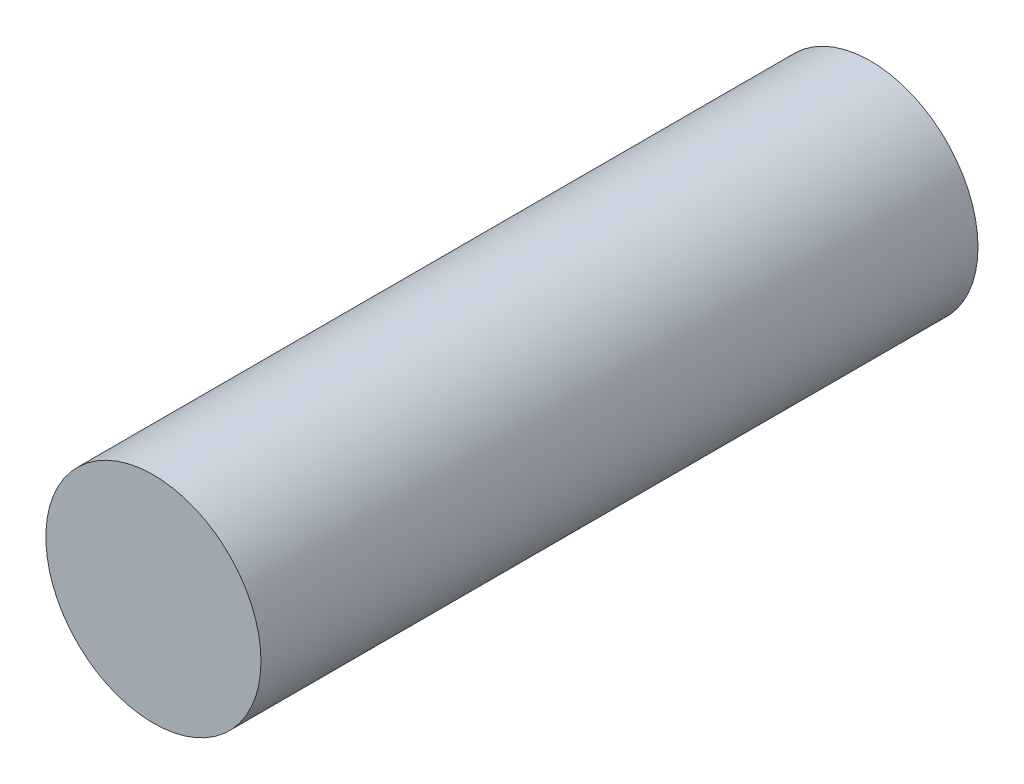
ISO-10303-21;
HEADER;
FILE_DESCRIPTION(('STEP AP214'),'2;1');
FILE_NAME('part.step','',(''),(''),'','','');
FILE_SCHEMA(('AUTOMOTIVE_DESIGN { 1 0 10303 214 1 1 1 1 }'));
ENDSEC;
DATA;
#1=APPLICATION_CONTEXT('core data for automotive mechanical design processes');
#2=APPLICATION_PROTOCOL_DEFINITION('international standard','automotive_design',2000,#1);
#3=PRODUCT_CONTEXT('',#1,'mechanical');
#4=PRODUCT('Part','Part','',(#3));
#5=PRODUCT_RELATED_PRODUCT_CATEGORY('part','',(#4));
#6=PRODUCT_DEFINITION_FORMATION('','',#4);
#7=PRODUCT_DEFINITION_CONTEXT('part definition',#1,'design');
#8=PRODUCT_DEFINITION('design','',#6,#7);
#9=PRODUCT_DEFINITION_SHAPE('','',#8);
#10=(LENGTH_UNIT() NAMED_UNIT(*) SI_UNIT(.MILLI.,.METRE.));
#11=(NAMED_UNIT(*) PLANE_ANGLE_UNIT() SI_UNIT($,.RADIAN.));
#12=(NAMED_UNIT(*) SI_UNIT($,.STERADIAN.) SOLID_ANGLE_UNIT());
#13=UNCERTAINTY_MEASURE_WITH_UNIT(LENGTH_MEASURE(1.E-05),#10,'distance_accuracy_value','');
#14=(GEOMETRIC_REPRESENTATION_CONTEXT(3) GLOBAL_UNCERTAINTY_ASSIGNED_CONTEXT((#13)) GLOBAL_UNIT_ASSIGNED_CONTEXT((#10,
#11,#12)) REPRESENTATION_CONTEXT('',''));
#15=CARTESIAN_POINT('',(0.,0.,0.));
#16=DIRECTION('',(0.,0.,1.));
#17=DIRECTION('',(1.,0.,0.));
#18=AXIS2_PLACEMENT_3D('',#15,#16,#17);
#19=CARTESIAN_POINT('',(0.,0.,5000.));
#20=DIRECTION('',(0.,0.,-1.));
#21=DIRECTION('',(-1.,0.,0.));
#22=AXIS2_PLACEMENT_3D('',#19,#20,#21);
#23=CYLINDRICAL_SURFACE('',#22,1500.);
#24=CARTESIAN_POINT('',(0.,0.,5000.));
#25=DIRECTION('',(0.,0.,1.));
#26=DIRECTION('',(1.,0.,0.));
#27=AXIS2_PLACEMENT_3D('',#24,#25,#26);
#28=CIRCLE('',#27,1500.);
#29=CARTESIAN_POINT('',(1500.,0.,5000.));
#30=VERTEX_POINT('',#29);
#31=EDGE_CURVE('E10',#30,#30,#28,.T.);
#32=ORIENTED_EDGE('',*,*,#31,.F.);
#33=EDGE_LOOP('',(#32));
#34=FACE_BOUND('',#33,.T.);
#35=CARTESIAN_POINT('',(0.,0.,-5000.));
#36=DIRECTION('',(0.,0.,1.));
#37=DIRECTION('',(1.,0.,0.));
#38=AXIS2_PLACEMENT_3D('',#35,#36,#37);
#39=CIRCLE('',#38,1500.);
#40=CARTESIAN_POINT('',(1500.,0.,-5000.));
#41=VERTEX_POINT('',#40);
#42=EDGE_CURVE('E34',#41,#41,#39,.T.);
#43=ORIENTED_EDGE('',*,*,#42,.T.);
#44=EDGE_LOOP('',(#43));
#45=FACE_BOUND('',#44,.T.);
#46=ADVANCED_FACE('F31',(#34,#45),#23,.T.);
#47=CARTESIAN_POINT('',(0.,0.,5000.));
#48=DIRECTION('',(0.,0.,1.));
#49=DIRECTION('',(1.,0.,0.));
#50=AXIS2_PLACEMENT_3D('',#47,#48,#49);
#51=PLANE('',#50);
#52=ORIENTED_EDGE('',*,*,#31,.T.);
#53=EDGE_LOOP('',(#52));
#54=FACE_BOUND('',#53,.T.);
#55=ADVANCED_FACE('F46',(#54),#51,.T.);
#56=CARTESIAN_POINT('',(0.,0.,-5000.));
#57=DIRECTION('',(0.,0.,1.));
#58=DIRECTION('',(1.,0.,0.));
#59=AXIS2_PLACEMENT_3D('',#56,#57,#58);
#60=PLANE('',#59);
#61=ORIENTED_EDGE('',*,*,#42,.F.);
#62=EDGE_LOOP('',(#61));
#63=FACE_BOUND('',#62,.T.);
#64=ADVANCED_FACE('F44',(#63),#60,.F.);
#65=CLOSED_SHELL('',(#46,#55,#64));
#66=MANIFOLD_SOLID_BREP('B2',#65);
#67=ADVANCED_BREP_SHAPE_REPRESENTATION('',(#18,#66),#14);
#68=SHAPE_DEFINITION_REPRESENTATION(#9,#67);
ENDSEC;
END-ISO-10303-21;
